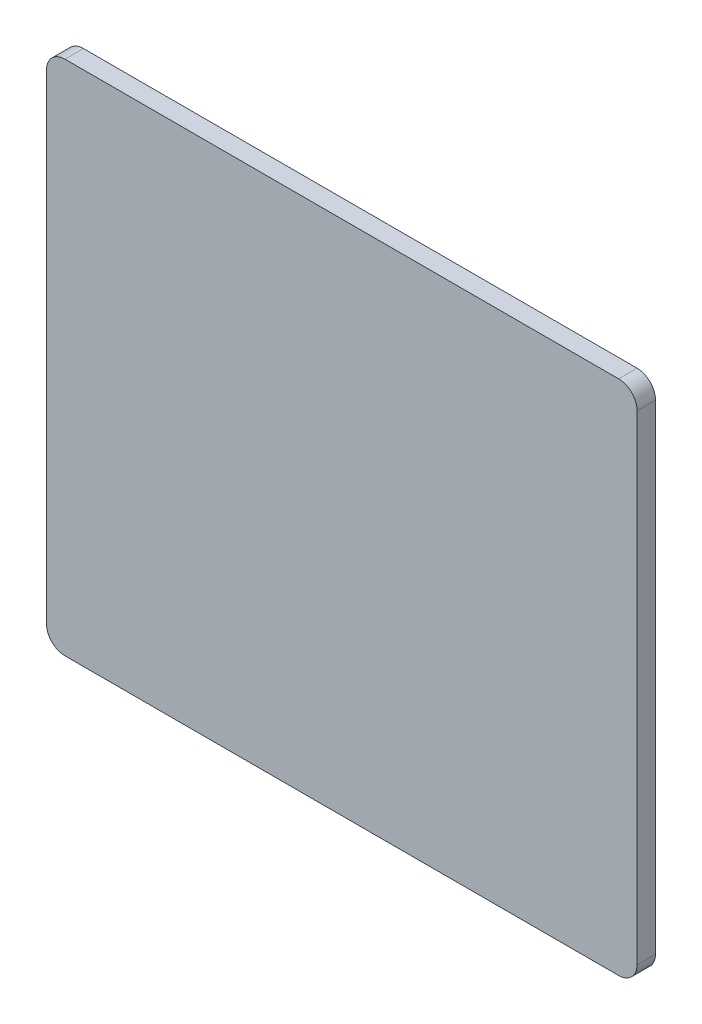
from build123d import *

# Parameters (mm, degrees)
EXTRUSION1_DEPTH = 1


with BuildPart() as part:
    # Esquisse1 → Extrusion1 (new body)
    with BuildSketch(Plane.XY):
        with BuildLine():
            Line((1, 28), (31, 28))
            ThreePointArc((31, 28), (31.707106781, 27.707106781), (32, 27))
            Line((32, 27), (32, 1))
            ThreePointArc((32, 1), (31.707106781, 0.292893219), (31, 0))
            Line((31, 0), (1, 0))
            ThreePointArc((1, 0), (0.292893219, 0.292893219), (0, 1))
            Line((0, 1), (0, 27))
            ThreePointArc((0, 27), (0.292893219, 27.707106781), (1, 28))
        make_face()
    extrude(amount=EXTRUSION1_DEPTH)


solid = part.part
